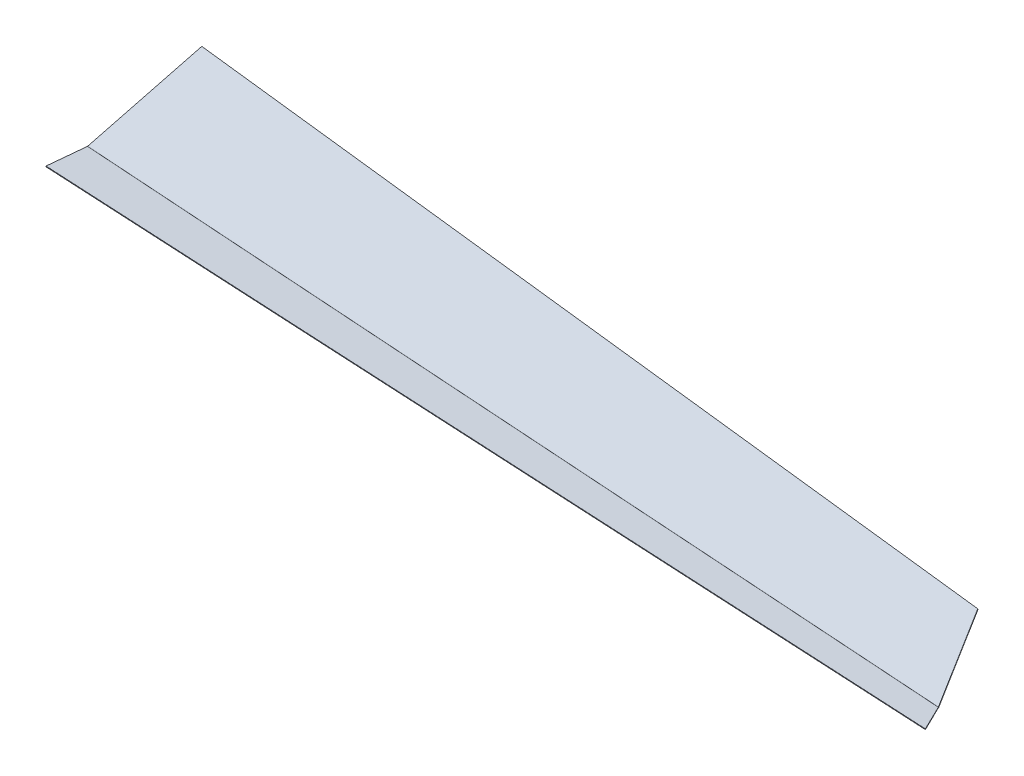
ISO-10303-21;
HEADER;
FILE_DESCRIPTION(('STEP AP214'),'2;1');
FILE_NAME('part.step','',(''),(''),'','','');
FILE_SCHEMA(('AUTOMOTIVE_DESIGN { 1 0 10303 214 1 1 1 1 }'));
ENDSEC;
DATA;
#1=APPLICATION_CONTEXT('core data for automotive mechanical design processes');
#2=APPLICATION_PROTOCOL_DEFINITION('international standard','automotive_design',2000,#1);
#3=PRODUCT_CONTEXT('',#1,'mechanical');
#4=PRODUCT('Part','Part','',(#3));
#5=PRODUCT_RELATED_PRODUCT_CATEGORY('part','',(#4));
#6=PRODUCT_DEFINITION_FORMATION('','',#4);
#7=PRODUCT_DEFINITION_CONTEXT('part definition',#1,'design');
#8=PRODUCT_DEFINITION('design','',#6,#7);
#9=PRODUCT_DEFINITION_SHAPE('','',#8);
#10=(LENGTH_UNIT() NAMED_UNIT(*) SI_UNIT(.MILLI.,.METRE.));
#11=(NAMED_UNIT(*) PLANE_ANGLE_UNIT() SI_UNIT($,.RADIAN.));
#12=(NAMED_UNIT(*) SI_UNIT($,.STERADIAN.) SOLID_ANGLE_UNIT());
#13=UNCERTAINTY_MEASURE_WITH_UNIT(LENGTH_MEASURE(1.E-05),#10,'distance_accuracy_value','');
#14=(GEOMETRIC_REPRESENTATION_CONTEXT(3) GLOBAL_UNCERTAINTY_ASSIGNED_CONTEXT((#13)) GLOBAL_UNIT_ASSIGNED_CONTEXT((#10,
#11,#12)) REPRESENTATION_CONTEXT('',''));
#15=CARTESIAN_POINT('',(0.,0.,0.));
#16=DIRECTION('',(0.,0.,1.));
#17=DIRECTION('',(1.,0.,0.));
#18=AXIS2_PLACEMENT_3D('',#15,#16,#17);
#19=CARTESIAN_POINT('',(2188.7684394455,8.46059764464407,-1126.59777767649));
#20=DIRECTION('',(0.895351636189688,0.158271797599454,-0.41628774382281));
#21=DIRECTION('',(-0.444128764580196,0.247856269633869,-0.860997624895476));
#22=AXIS2_PLACEMENT_3D('',#19,#20,#21);
#23=PLANE('',#22);
#24=DIRECTION('',(-0.0330921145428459,0.955780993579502,0.29221157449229));
#25=VECTOR('',#24,1.);
#26=CARTESIAN_POINT('',(2408.5968875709,-114.219722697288,-700.433595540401));
#27=LINE('',#26,#25);
#28=CARTESIAN_POINT('',(2408.65068211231,-115.773440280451,-700.908614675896));
#29=VERTEX_POINT('',#28);
#30=CARTESIAN_POINT('',(2408.5968875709,-114.219722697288,-700.433595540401));
#31=VERTEX_POINT('',#30);
#32=EDGE_CURVE('E12',#29,#31,#27,.T.);
#33=ORIENTED_EDGE('',*,*,#32,.F.);
#34=DIRECTION('',(-0.444128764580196,0.247856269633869,-0.860997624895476));
#35=VECTOR('',#34,1.);
#36=CARTESIAN_POINT('',(2188.8222339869,6.90688006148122,-1127.07279681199));
#37=LINE('',#36,#35);
#38=CARTESIAN_POINT('',(2303.8847141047,-57.3063827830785,-904.010185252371));
#39=VERTEX_POINT('',#38);
#40=EDGE_CURVE('E165',#29,#39,#37,.T.);
#41=ORIENTED_EDGE('',*,*,#40,.T.);
#42=DIRECTION('',(-0.0330921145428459,0.955780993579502,0.29221157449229));
#43=VECTOR('',#42,1.);
#44=CARTESIAN_POINT('',(2303.8309195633,-55.7526651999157,-903.535166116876));
#45=LINE('',#44,#43);
#46=CARTESIAN_POINT('',(2303.8309195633,-55.7526651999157,-903.535166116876));
#47=VERTEX_POINT('',#46);
#48=EDGE_CURVE('E125',#39,#47,#45,.T.);
#49=ORIENTED_EDGE('',*,*,#48,.T.);
#50=DIRECTION('',(-0.444128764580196,0.247856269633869,-0.860997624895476));
#51=VECTOR('',#50,1.);
#52=CARTESIAN_POINT('',(2188.7684394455,8.46059764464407,-1126.59777767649));
#53=LINE('',#52,#51);
#54=EDGE_CURVE('E168',#31,#47,#53,.T.);
#55=ORIENTED_EDGE('',*,*,#54,.F.);
#56=EDGE_LOOP('',(#33,#41,#49,#55));
#57=FACE_BOUND('',#56,.T.);
#58=ADVANCED_FACE('F112',(#57),#23,.T.);
#59=CARTESIAN_POINT('',(2552.6462054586,-55.7520347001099,-875.359617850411));
#60=DIRECTION('',(0.107543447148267,0.294079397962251,-0.94971138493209));
#61=DIRECTION('',(-0.993649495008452,-2.51791529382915E-06,-0.112519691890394));
#62=AXIS2_PLACEMENT_3D('',#59,#60,#61);
#63=PLANE('',#62);
#64=ORIENTED_EDGE('',*,*,#48,.F.);
#65=DIRECTION('',(-0.993649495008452,-2.51791529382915E-06,-0.112519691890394));
#66=VECTOR('',#65,1.);
#67=CARTESIAN_POINT('',(2552.7,-57.3057522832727,-875.834636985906));
#68=LINE('',#67,#66);
#69=CARTESIAN_POINT('',(119.079175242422,-57.3119190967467,-1151.41497668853));
#70=VERTEX_POINT('',#69);
#71=EDGE_CURVE('E194',#39,#70,#68,.T.);
#72=ORIENTED_EDGE('',*,*,#71,.T.);
#73=DIRECTION('',(-0.0330921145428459,0.955780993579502,0.29221157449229));
#74=VECTOR('',#73,1.);
#75=CARTESIAN_POINT('',(119.025380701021,-55.7582015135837,-1150.93995755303));
#76=LINE('',#75,#74);
#77=CARTESIAN_POINT('',(119.025380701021,-55.7582015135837,-1150.93995755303));
#78=VERTEX_POINT('',#77);
#79=EDGE_CURVE('E219',#70,#78,#76,.T.);
#80=ORIENTED_EDGE('',*,*,#79,.T.);
#81=DIRECTION('',(-0.993649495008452,-2.51791529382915E-06,-0.112519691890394));
#82=VECTOR('',#81,1.);
#83=CARTESIAN_POINT('',(2552.6462054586,-55.7520347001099,-875.359617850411));
#84=LINE('',#83,#82);
#85=EDGE_CURVE('E232',#47,#78,#84,.T.);
#86=ORIENTED_EDGE('',*,*,#85,.F.);
#87=EDGE_LOOP('',(#64,#72,#80,#86));
#88=FACE_BOUND('',#87,.T.);
#89=ADVANCED_FACE('F239',(#88),#63,.T.);
#90=CARTESIAN_POINT('',(78.2546476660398,-374.797848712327,-112.025459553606));
#91=DIRECTION('',(0.998748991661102,0.020657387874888,0.0455381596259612));
#92=DIRECTION('',(0.0374881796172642,0.29335296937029,-0.955268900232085));
#93=AXIS2_PLACEMENT_3D('',#90,#91,#92);
#94=PLANE('',#93);
#95=ORIENTED_EDGE('',*,*,#79,.F.);
#96=DIRECTION('',(0.0374881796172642,0.29335296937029,-0.955268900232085));
#97=VECTOR('',#96,1.);
#98=CARTESIAN_POINT('',(78.3084422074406,-376.35156629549,-112.500478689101));
#99=LINE('',#98,#97);
#100=CARTESIAN_POINT('',(108.318903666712,-141.513330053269,-877.223140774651));
#101=VERTEX_POINT('',#100);
#102=EDGE_CURVE('E282',#101,#70,#99,.T.);
#103=ORIENTED_EDGE('',*,*,#102,.F.);
#104=DIRECTION('',(-0.033092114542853,0.955780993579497,0.292211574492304));
#105=VECTOR('',#104,1.);
#106=CARTESIAN_POINT('',(108.265109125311,-139.959612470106,-876.748121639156));
#107=LINE('',#106,#105);
#108=CARTESIAN_POINT('',(108.265109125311,-139.959612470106,-876.748121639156));
#109=VERTEX_POINT('',#108);
#110=EDGE_CURVE('E215',#101,#109,#107,.T.);
#111=ORIENTED_EDGE('',*,*,#110,.T.);
#112=DIRECTION('',(0.0374881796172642,0.29335296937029,-0.955268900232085));
#113=VECTOR('',#112,1.);
#114=CARTESIAN_POINT('',(78.2546476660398,-374.797848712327,-112.025459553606));
#115=LINE('',#114,#113);
#116=EDGE_CURVE('E241',#109,#78,#115,.T.);
#117=ORIENTED_EDGE('',*,*,#116,.T.);
#118=EDGE_LOOP('',(#95,#103,#111,#117));
#119=FACE_BOUND('',#118,.T.);
#120=ADVANCED_FACE('F289',(#119),#94,.F.);
#121=CARTESIAN_POINT('',(108.431680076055,-139.337979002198,-879.380151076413));
#122=CARTESIAN_POINT('',(108.390278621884,-139.182683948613,-878.862667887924));
#123=CARTESIAN_POINT('',(108.348877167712,-139.027388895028,-878.345184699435));
#124=CARTESIAN_POINT('',(108.307475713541,-138.872093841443,-877.827701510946));
#125=CARTESIAN_POINT('',(108.358548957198,-145.567197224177,-877.516633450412));
#126=CARTESIAN_POINT('',(108.329336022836,-144.373699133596,-877.309736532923));
#127=CARTESIAN_POINT('',(108.300123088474,-143.180201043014,-877.102839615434));
#128=CARTESIAN_POINT('',(108.270910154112,-141.986702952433,-876.895942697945));
#129=CARTESIAN_POINT('',(107.987913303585,-143.70224465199,-871.29716367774));
#130=CARTESIAN_POINT('',(108.041503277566,-142.819336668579,-872.12523313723));
#131=CARTESIAN_POINT('',(108.095093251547,-141.936428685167,-872.953302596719));
#132=CARTESIAN_POINT('',(108.148683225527,-141.053520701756,-873.781372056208));
#133=CARTESIAN_POINT('',(108.061044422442,-137.473026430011,-873.160681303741));
#134=CARTESIAN_POINT('',(108.102445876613,-137.628321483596,-873.678164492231));
#135=CARTESIAN_POINT('',(108.143847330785,-137.783616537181,-874.19564768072));
#136=CARTESIAN_POINT('',(108.185248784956,-137.938911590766,-874.713130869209));
#137=CARTESIAN_POINT('',(108.134175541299,-131.243808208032,-875.024198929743));
#138=CARTESIAN_POINT('',(108.163388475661,-132.437306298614,-875.231095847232));
#139=CARTESIAN_POINT('',(108.192601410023,-133.630804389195,-875.437992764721));
#140=CARTESIAN_POINT('',(108.221814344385,-134.824302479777,-875.64488968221));
#141=CARTESIAN_POINT('',(108.504811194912,-133.108760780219,-881.243668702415));
#142=CARTESIAN_POINT('',(108.451221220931,-133.991668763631,-880.415599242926));
#143=CARTESIAN_POINT('',(108.39763124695,-134.874576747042,-879.587529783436));
#144=CARTESIAN_POINT('',(108.34404127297,-135.757484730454,-878.759460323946));
#145=CARTESIAN_POINT('',(108.431680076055,-139.337979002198,-879.380151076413));
#146=CARTESIAN_POINT('',(108.390278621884,-139.182683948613,-878.862667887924));
#147=CARTESIAN_POINT('',(108.348877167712,-139.027388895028,-878.345184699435));
#148=CARTESIAN_POINT('',(108.307475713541,-138.872093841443,-877.827701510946));
#149=(BOUNDED_SURFACE() B_SPLINE_SURFACE(3,3,((#121,#122,#123,#124),(#125,#126,#127,#128),(#129,
#130,#131,#132),(#133,#134,#135,#136),(#137,#138,#139,#140),(#141,#142,#143,#144),(#145,#146,
#147,#148)),.UNSPECIFIED.,.T.,.F.,.F.) B_SPLINE_SURFACE_WITH_KNOTS((4,3,4),(4,4),(0.,0.5,1.),
(0.,1.),.UNSPECIFIED.) GEOMETRIC_REPRESENTATION_ITEM() RATIONAL_B_SPLINE_SURFACE(((1.,1.,1.,1.),
(0.333333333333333,0.333333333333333,0.333333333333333,0.333333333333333),(0.333333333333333,
0.333333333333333,0.333333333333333,0.333333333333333),(1.,1.,1.,1.),(0.333333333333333,
0.333333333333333,0.333333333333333,0.333333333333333),(0.333333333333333,0.333333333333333,
0.333333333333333,0.333333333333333),(1.,1.,1.,1.))) REPRESENTATION_ITEM('') SURFACE());
#150=CARTESIAN_POINT('',(108.246362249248,-138.405502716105,-876.270416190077));
#151=DIRECTION('',(0.998311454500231,0.00557705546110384,0.0578198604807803));
#152=DIRECTION('',(0.0569890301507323,-0.286755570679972,-0.956307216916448));
#153=AXIS2_PLACEMENT_3D('',#150,#151,#152);
#154=ELLIPSE('',#153,3.25181576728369,3.2512);
#155=CARTESIAN_POINT('',(108.254484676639,-141.652125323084,-876.097501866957));
#156=VERTEX_POINT('',#155);
#157=EDGE_CURVE('E183',#101,#156,#154,.F.);
#158=DIRECTION('',(-0.00706998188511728,0.998540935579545,-0.0535351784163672));
#159=VECTOR('',#158,1.);
#160=CARTESIAN_POINT('',(108.242991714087,-140.028897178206,-876.184528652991));
#161=LINE('',#160,#159);
#162=CARTESIAN_POINT('',(108.242991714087,-140.028897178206,-876.184528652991));
#163=VERTEX_POINT('',#162);
#164=EDGE_CURVE('E133',#156,#163,#161,.T.);
#165=CARTESIAN_POINT('',(108.246362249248,-138.405502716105,-876.270416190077));
#166=DIRECTION('',(0.999230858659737,0.,0.0392134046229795));
#167=DIRECTION('',(0.0375659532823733,-0.286809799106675,-0.957250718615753));
#168=AXIS2_PLACEMENT_3D('',#165,#166,#167);
#169=ELLIPSE('',#168,1.62683118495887,1.6256);
#170=EDGE_CURVE('E237',#109,#163,#169,.F.);
#171=ORIENTED_EDGE('',*,*,#110,.F.);
#172=ORIENTED_EDGE('',*,*,#157,.T.);
#173=ORIENTED_EDGE('',*,*,#164,.T.);
#174=ORIENTED_EDGE('',*,*,#170,.F.);
#175=EDGE_LOOP('',(#171,#172,#173,#174));
#176=FACE_BOUND('',#175,.T.);
#177=ADVANCED_FACE('F292',(#176),#149,.T.);
#178=CARTESIAN_POINT('',(73.5506912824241,-92.8789577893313,7.84014307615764));
#179=DIRECTION('',(0.999208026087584,0.0091508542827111,0.0387244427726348));
#180=DIRECTION('',(0.0391578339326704,-0.0532189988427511,-0.997814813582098));
#181=AXIS2_PLACEMENT_3D('',#178,#179,#180);
#182=PLANE('',#181);
#183=ORIENTED_EDGE('',*,*,#164,.F.);
#184=DIRECTION('',(0.0391578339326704,-0.0532189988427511,-0.997814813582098));
#185=VECTOR('',#184,1.);
#186=CARTESIAN_POINT('',(73.5621842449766,-94.5021859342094,7.92716986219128));
#187=LINE('',#186,#185);
#188=CARTESIAN_POINT('',(104.350584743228,-136.346376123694,-776.618833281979));
#189=VERTEX_POINT('',#188);
#190=EDGE_CURVE('E189',#189,#156,#187,.T.);
#191=ORIENTED_EDGE('',*,*,#190,.F.);
#192=DIRECTION('',(-0.00706998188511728,0.998540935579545,-0.0535351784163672));
#193=VECTOR('',#192,1.);
#194=CARTESIAN_POINT('',(104.33909178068,-134.723147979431,-776.70586006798));
#195=LINE('',#194,#193);
#196=CARTESIAN_POINT('',(104.33909178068,-134.723147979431,-776.70586006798));
#197=VERTEX_POINT('',#196);
#198=EDGE_CURVE('E209',#189,#197,#195,.T.);
#199=ORIENTED_EDGE('',*,*,#198,.T.);
#200=DIRECTION('',(0.0391578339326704,-0.0532189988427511,-0.997814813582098));
#201=VECTOR('',#200,1.);
#202=CARTESIAN_POINT('',(73.5506912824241,-92.8789577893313,7.84014307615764));
#203=LINE('',#202,#201);
#204=EDGE_CURVE('E258',#197,#163,#203,.T.);
#205=ORIENTED_EDGE('',*,*,#204,.T.);
#206=EDGE_LOOP('',(#183,#191,#199,#205));
#207=FACE_BOUND('',#206,.T.);
#208=ADVANCED_FACE('F316',(#207),#182,.F.);
#209=CARTESIAN_POINT('',(78.9657016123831,-134.986230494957,-778.262019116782));
#210=DIRECTION('',(-0.0616767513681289,0.0529991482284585,0.996688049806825));
#211=DIRECTION('',(0.998071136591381,0.0103484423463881,0.0612120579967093));
#212=AXIS2_PLACEMENT_3D('',#209,#210,#211);
#213=PLANE('',#212);
#214=ORIENTED_EDGE('',*,*,#198,.F.);
#215=DIRECTION('',(0.998071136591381,0.0103484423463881,0.0612120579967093));
#216=VECTOR('',#215,1.);
#217=CARTESIAN_POINT('',(78.9771945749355,-136.609458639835,-778.174992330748));
#218=LINE('',#217,#216);
#219=CARTESIAN_POINT('',(2443.2586702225,-112.095544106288,-633.172768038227));
#220=VERTEX_POINT('',#219);
#221=EDGE_CURVE('E278',#189,#220,#218,.T.);
#222=ORIENTED_EDGE('',*,*,#221,.T.);
#223=DIRECTION('',(-0.00706998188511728,0.998540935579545,-0.0535351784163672));
#224=VECTOR('',#223,1.);
#225=CARTESIAN_POINT('',(2443.24717725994,-110.472315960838,-633.259794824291));
#226=LINE('',#225,#224);
#227=CARTESIAN_POINT('',(2443.24717725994,-110.472315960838,-633.259794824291));
#228=VERTEX_POINT('',#227);
#229=EDGE_CURVE('E205',#220,#228,#226,.T.);
#230=ORIENTED_EDGE('',*,*,#229,.T.);
#231=DIRECTION('',(0.998071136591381,0.0103484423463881,0.0612120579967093));
#232=VECTOR('',#231,1.);
#233=CARTESIAN_POINT('',(78.9657016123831,-134.986230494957,-778.262019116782));
#234=LINE('',#233,#232);
#235=EDGE_CURVE('E244',#197,#228,#234,.T.);
#236=ORIENTED_EDGE('',*,*,#235,.F.);
#237=EDGE_LOOP('',(#214,#222,#230,#236));
#238=FACE_BOUND('',#237,.T.);
#239=ADVANCED_FACE('F302',(#238),#213,.T.);
#240=CARTESIAN_POINT('',(2191.00694568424,-138.475122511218,-1122.25816108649));
#241=DIRECTION('',(0.889006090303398,-0.0182354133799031,-0.457532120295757));
#242=DIRECTION('',(-0.457840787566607,-0.0508278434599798,-0.887580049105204));
#243=AXIS2_PLACEMENT_3D('',#240,#241,#242);
#244=PLANE('',#243);
#245=ORIENTED_EDGE('',*,*,#229,.F.);
#246=DIRECTION('',(-0.457840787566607,-0.0508278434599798,-0.887580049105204));
#247=VECTOR('',#246,1.);
#248=CARTESIAN_POINT('',(2191.01843864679,-140.098350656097,-1122.17113430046));
#249=LINE('',#248,#247);
#250=CARTESIAN_POINT('',(2408.91197670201,-115.908590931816,-699.758010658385));
#251=VERTEX_POINT('',#250);
#252=EDGE_CURVE('E275',#220,#251,#249,.T.);
#253=ORIENTED_EDGE('',*,*,#252,.T.);
#254=DIRECTION('',(-0.00706998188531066,0.998540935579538,-0.0535351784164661));
#255=VECTOR('',#254,1.);
#256=CARTESIAN_POINT('',(2408.90048373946,-114.285362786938,-699.845037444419));
#257=LINE('',#256,#255);
#258=CARTESIAN_POINT('',(2408.90048373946,-114.285362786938,-699.845037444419));
#259=VERTEX_POINT('',#258);
#260=EDGE_CURVE('E118',#251,#259,#257,.T.);
#261=ORIENTED_EDGE('',*,*,#260,.T.);
#262=DIRECTION('',(-0.457840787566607,-0.0508278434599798,-0.887580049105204));
#263=VECTOR('',#262,1.);
#264=CARTESIAN_POINT('',(2191.00694568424,-138.475122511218,-1122.25816108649));
#265=LINE('',#264,#263);
#266=EDGE_CURVE('E252',#228,#259,#265,.T.);
#267=ORIENTED_EDGE('',*,*,#266,.F.);
#268=EDGE_LOOP('',(#245,#253,#261,#267));
#269=FACE_BOUND('',#268,.T.);
#270=ADVANCED_FACE('F310',(#269),#244,.T.);
#271=CARTESIAN_POINT('',(2408.10328875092,-112.732499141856,-703.252489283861));
#272=CARTESIAN_POINT('',(2408.06177530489,-112.722701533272,-702.712304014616));
#273=CARTESIAN_POINT('',(2408.02026185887,-112.712903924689,-702.17211874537));
#274=CARTESIAN_POINT('',(2407.97874841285,-112.703106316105,-701.631933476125));
#275=CARTESIAN_POINT('',(2408.03995624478,-106.231566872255,-703.375267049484));
#276=CARTESIAN_POINT('',(2408.00899821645,-107.305257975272,-702.814618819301));
#277=CARTESIAN_POINT('',(2407.97804018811,-108.378949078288,-702.253970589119));
#278=CARTESIAN_POINT('',(2407.94708215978,-109.452640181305,-701.693322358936));
#279=CARTESIAN_POINT('',(2409.54181445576,-106.091616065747,-696.739747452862));
#280=CARTESIAN_POINT('',(2409.59388331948,-107.184902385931,-697.259469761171));
#281=CARTESIAN_POINT('',(2409.64595218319,-108.278188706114,-697.779192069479));
#282=CARTESIAN_POINT('',(2409.6980210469,-109.371475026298,-698.298914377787));
#283=CARTESIAN_POINT('',(2409.6051469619,-112.592548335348,-696.61696968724));
#284=CARTESIAN_POINT('',(2409.64666040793,-112.602345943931,-697.157154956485));
#285=CARTESIAN_POINT('',(2409.68817385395,-112.612143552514,-697.697340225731));
#286=CARTESIAN_POINT('',(2409.72968729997,-112.621941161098,-698.237525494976));
#287=CARTESIAN_POINT('',(2409.66847946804,-119.093480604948,-696.494191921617));
#288=CARTESIAN_POINT('',(2409.69943749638,-118.019789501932,-697.0548401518));
#289=CARTESIAN_POINT('',(2409.73039552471,-116.946098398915,-697.615488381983));
#290=CARTESIAN_POINT('',(2409.76135355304,-115.872407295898,-698.176136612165));
#291=CARTESIAN_POINT('',(2408.16662125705,-119.233431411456,-703.129711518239));
#292=CARTESIAN_POINT('',(2408.11455239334,-118.140145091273,-702.60998920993));
#293=CARTESIAN_POINT('',(2408.06248352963,-117.046858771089,-702.090266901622));
#294=CARTESIAN_POINT('',(2408.01041466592,-115.953572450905,-701.570544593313));
#295=CARTESIAN_POINT('',(2408.10328875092,-112.732499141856,-703.252489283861));
#296=CARTESIAN_POINT('',(2408.06177530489,-112.722701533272,-702.712304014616));
#297=CARTESIAN_POINT('',(2408.02026185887,-112.712903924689,-702.17211874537));
#298=CARTESIAN_POINT('',(2407.97874841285,-112.703106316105,-701.631933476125));
#299=(BOUNDED_SURFACE() B_SPLINE_SURFACE(3,3,((#271,#272,#273,#274),(#275,#276,#277,#278),(#279,
#280,#281,#282),(#283,#284,#285,#286),(#287,#288,#289,#290),(#291,#292,#293,#294),(#295,#296,
#297,#298)),.UNSPECIFIED.,.T.,.F.,.F.) B_SPLINE_SURFACE_WITH_KNOTS((4,3,4),(4,4),(0.,0.5,1.),
(0.,1.),.UNSPECIFIED.) GEOMETRIC_REPRESENTATION_ITEM() RATIONAL_B_SPLINE_SURFACE(((1.,1.,1.,1.),
(0.333333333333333,0.333333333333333,0.333333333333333,0.333333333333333),(0.333333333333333,
0.333333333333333,0.333333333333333,0.333333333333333),(1.,1.,1.,1.),(0.333333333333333,
0.333333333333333,0.333333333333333,0.333333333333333),(0.333333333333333,0.333333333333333,
0.333333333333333,0.333333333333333),(1.,1.,1.,1.))) REPRESENTATION_ITEM('') SURFACE());
#300=CARTESIAN_POINT('',(2408.85421785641,-112.662523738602,-699.934729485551));
#301=DIRECTION('',(-0.975291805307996,-0.00533022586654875,0.220856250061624));
#302=DIRECTION('',(-0.22070575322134,-0.0205664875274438,-0.975123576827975));
#303=AXIS2_PLACEMENT_3D('',#300,#301,#302);
#304=ELLIPSE('',#303,3.40239932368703,3.2512);
#305=EDGE_CURVE('E181',#251,#29,#304,.F.);
#306=CARTESIAN_POINT('',(2408.85421785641,-112.662523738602,-699.934729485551));
#307=DIRECTION('',(-0.888728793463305,0.,0.458433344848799));
#308=DIRECTION('',(-0.45832986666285,-0.0212459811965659,-0.888528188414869));
#309=AXIS2_PLACEMENT_3D('',#306,#307,#308);
#310=ELLIPSE('',#309,1.91012959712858,1.6256);
#311=EDGE_CURVE('E268',#259,#31,#310,.F.);
#312=ORIENTED_EDGE('',*,*,#305,.T.);
#313=ORIENTED_EDGE('',*,*,#32,.T.);
#314=ORIENTED_EDGE('',*,*,#311,.F.);
#315=ORIENTED_EDGE('',*,*,#260,.F.);
#316=EDGE_LOOP('',(#312,#313,#314,#315));
#317=FACE_BOUND('',#316,.T.);
#318=ADVANCED_FACE('F114',(#317),#299,.T.);
#319=CARTESIAN_POINT('',(0.662338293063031,-93.5464771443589,5.01534505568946));
#320=DIRECTION('',(-0.00706998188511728,0.998540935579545,-0.0535351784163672));
#321=DIRECTION('',(0.,0.0535365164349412,0.998565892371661));
#322=AXIS2_PLACEMENT_3D('',#319,#320,#321);
#323=PLANE('',#322);
#324=ORIENTED_EDGE('',*,*,#266,.T.);
#325=DIRECTION('',(0.997013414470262,0.0111562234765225,0.0764185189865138));
#326=VECTOR('',#325,1.);
#327=CARTESIAN_POINT('',(108.232114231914,-140.02901889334,-876.185362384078));
#328=LINE('',#327,#326);
#329=EDGE_CURVE('E264',#259,#163,#328,.F.);
#330=ORIENTED_EDGE('',*,*,#329,.T.);
#331=ORIENTED_EDGE('',*,*,#204,.F.);
#332=ORIENTED_EDGE('',*,*,#235,.T.);
#333=EDGE_LOOP('',(#324,#330,#331,#332));
#334=FACE_BOUND('',#333,.T.);
#335=ADVANCED_FACE('F309',(#334),#323,.T.);
#336=CARTESIAN_POINT('',(13.0233820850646,-376.147044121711,-114.999692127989));
#337=DIRECTION('',(-0.0330921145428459,0.955780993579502,0.29221157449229));
#338=DIRECTION('',(0.,-0.29237170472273,0.956304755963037));
#339=AXIS2_PLACEMENT_3D('',#336,#337,#338);
#340=PLANE('',#339);
#341=ORIENTED_EDGE('',*,*,#116,.F.);
#342=DIRECTION('',(0.997013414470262,0.0111562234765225,0.0764185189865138));
#343=VECTOR('',#342,1.);
#344=CARTESIAN_POINT('',(2408.7654877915,-114.217836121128,-700.420672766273));
#345=LINE('',#344,#343);
#346=EDGE_CURVE('E235',#109,#31,#345,.T.);
#347=ORIENTED_EDGE('',*,*,#346,.T.);
#348=ORIENTED_EDGE('',*,*,#54,.T.);
#349=ORIENTED_EDGE('',*,*,#85,.T.);
#350=EDGE_LOOP('',(#341,#347,#348,#349));
#351=FACE_BOUND('',#350,.T.);
#352=ADVANCED_FACE('F231',(#351),#340,.T.);
#353=CARTESIAN_POINT('',(68.9483755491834,-138.8452331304,-879.282505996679));
#354=DIRECTION('',(-0.997013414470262,-0.0111562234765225,-0.0764185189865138));
#355=DIRECTION('',(-0.0764232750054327,0.,0.997075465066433));
#356=AXIS2_PLACEMENT_3D('',#353,#354,#355);
#357=CYLINDRICAL_SURFACE('',#356,1.6256);
#358=ORIENTED_EDGE('',*,*,#170,.T.);
#359=ORIENTED_EDGE('',*,*,#329,.F.);
#360=ORIENTED_EDGE('',*,*,#311,.T.);
#361=ORIENTED_EDGE('',*,*,#346,.F.);
#362=EDGE_LOOP('',(#358,#359,#360,#361));
#363=FACE_BOUND('',#362,.T.);
#364=ADVANCED_FACE('F295',(#363),#357,.F.);
#365=CARTESIAN_POINT('',(0.673831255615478,-95.169705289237,5.10237184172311));
#366=DIRECTION('',(-0.00706998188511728,0.998540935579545,-0.0535351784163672));
#367=DIRECTION('',(0.,0.0535365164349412,0.998565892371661));
#368=AXIS2_PLACEMENT_3D('',#365,#366,#367);
#369=PLANE('',#368);
#370=ORIENTED_EDGE('',*,*,#252,.F.);
#371=ORIENTED_EDGE('',*,*,#221,.F.);
#372=ORIENTED_EDGE('',*,*,#190,.T.);
#373=DIRECTION('',(-0.997013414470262,-0.0111562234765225,-0.0764185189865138));
#374=VECTOR('',#373,1.);
#375=CARTESIAN_POINT('',(68.9713614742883,-142.091689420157,-879.108452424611));
#376=LINE('',#375,#374);
#377=EDGE_CURVE('E188',#251,#156,#376,.T.);
#378=ORIENTED_EDGE('',*,*,#377,.F.);
#379=EDGE_LOOP('',(#370,#371,#372,#378));
#380=FACE_BOUND('',#379,.T.);
#381=ADVANCED_FACE('F313',(#380),#369,.F.);
#382=CARTESIAN_POINT('',(13.0771766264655,-377.700761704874,-115.474711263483));
#383=DIRECTION('',(-0.0330921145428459,0.955780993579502,0.29221157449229));
#384=DIRECTION('',(0.,-0.29237170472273,0.956304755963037));
#385=AXIS2_PLACEMENT_3D('',#382,#383,#384);
#386=PLANE('',#385);
#387=ORIENTED_EDGE('',*,*,#102,.T.);
#388=ORIENTED_EDGE('',*,*,#71,.F.);
#389=ORIENTED_EDGE('',*,*,#40,.F.);
#390=DIRECTION('',(-0.997013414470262,-0.0111562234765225,-0.0764185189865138));
#391=VECTOR('',#390,1.);
#392=CARTESIAN_POINT('',(69.0559646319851,-141.952668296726,-880.232544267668));
#393=LINE('',#392,#391);
#394=EDGE_CURVE('E178',#101,#29,#393,.F.);
#395=ORIENTED_EDGE('',*,*,#394,.F.);
#396=EDGE_LOOP('',(#387,#388,#389,#395));
#397=FACE_BOUND('',#396,.T.);
#398=ADVANCED_FACE('F192',(#397),#386,.F.);
#399=CARTESIAN_POINT('',(68.9483755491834,-138.8452331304,-879.282505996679));
#400=DIRECTION('',(-0.997013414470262,-0.0111562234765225,-0.0764185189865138));
#401=DIRECTION('',(-0.0764232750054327,0.,0.997075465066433));
#402=AXIS2_PLACEMENT_3D('',#399,#400,#401);
#403=CYLINDRICAL_SURFACE('',#402,3.2512);
#404=ORIENTED_EDGE('',*,*,#157,.F.);
#405=ORIENTED_EDGE('',*,*,#394,.T.);
#406=ORIENTED_EDGE('',*,*,#305,.F.);
#407=ORIENTED_EDGE('',*,*,#377,.T.);
#408=EDGE_LOOP('',(#404,#405,#406,#407));
#409=FACE_BOUND('',#408,.T.);
#410=ADVANCED_FACE('F179',(#409),#403,.T.);
#411=CLOSED_SHELL('',(#58,#89,#120,#177,#208,#239,#270,#318,#335,#352,#364,#381,#398,#410));
#412=MANIFOLD_SOLID_BREP('B2',#411);
#413=ADVANCED_BREP_SHAPE_REPRESENTATION('',(#18,#412),#14);
#414=SHAPE_DEFINITION_REPRESENTATION(#9,#413);
ENDSEC;
END-ISO-10303-21;
